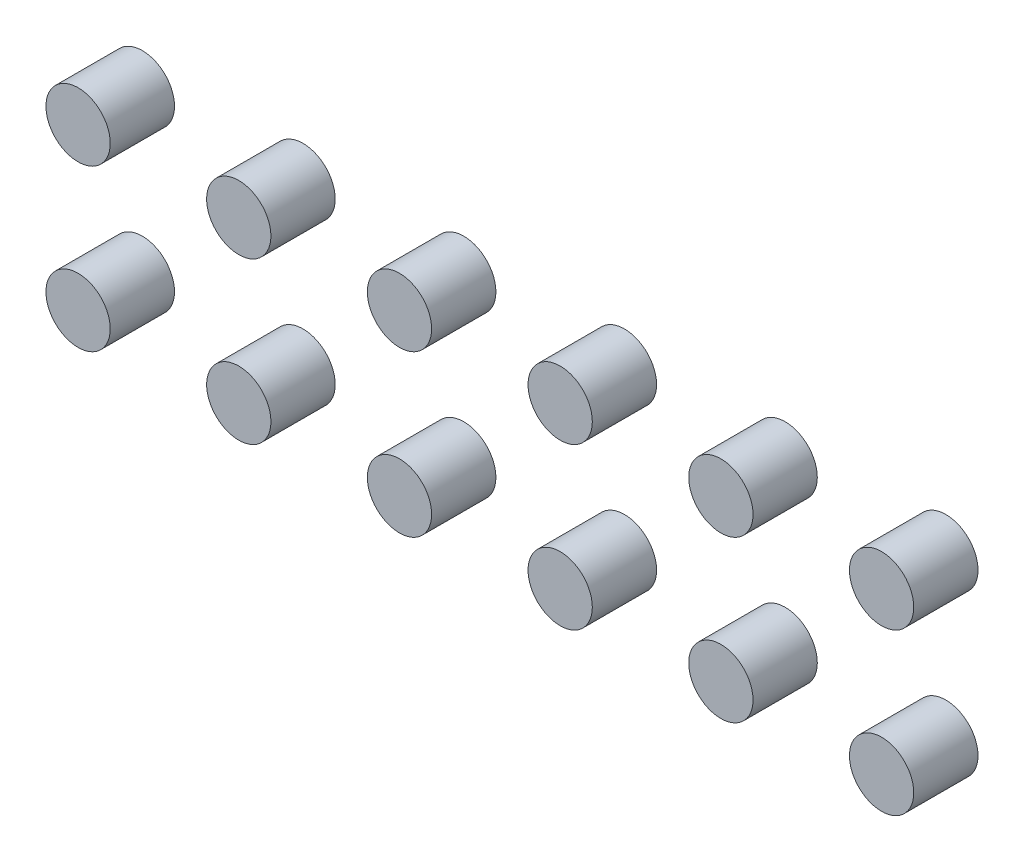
ISO-10303-21;
HEADER;
FILE_DESCRIPTION(('STEP AP214'),'2;1');
FILE_NAME('part.step','',(''),(''),'','','');
FILE_SCHEMA(('AUTOMOTIVE_DESIGN { 1 0 10303 214 1 1 1 1 }'));
ENDSEC;
DATA;
#1=APPLICATION_CONTEXT('core data for automotive mechanical design processes');
#2=APPLICATION_PROTOCOL_DEFINITION('international standard','automotive_design',2000,#1);
#3=PRODUCT_CONTEXT('',#1,'mechanical');
#4=PRODUCT('Part','Part','',(#3));
#5=PRODUCT_RELATED_PRODUCT_CATEGORY('part','',(#4));
#6=PRODUCT_DEFINITION_FORMATION('','',#4);
#7=PRODUCT_DEFINITION_CONTEXT('part definition',#1,'design');
#8=PRODUCT_DEFINITION('design','',#6,#7);
#9=PRODUCT_DEFINITION_SHAPE('','',#8);
#10=(LENGTH_UNIT() NAMED_UNIT(*) SI_UNIT(.MILLI.,.METRE.));
#11=(NAMED_UNIT(*) PLANE_ANGLE_UNIT() SI_UNIT($,.RADIAN.));
#12=(NAMED_UNIT(*) SI_UNIT($,.STERADIAN.) SOLID_ANGLE_UNIT());
#13=UNCERTAINTY_MEASURE_WITH_UNIT(LENGTH_MEASURE(1.E-05),#10,'distance_accuracy_value','');
#14=(GEOMETRIC_REPRESENTATION_CONTEXT(3) GLOBAL_UNCERTAINTY_ASSIGNED_CONTEXT((#13)) GLOBAL_UNIT_ASSIGNED_CONTEXT((#10,
#11,#12)) REPRESENTATION_CONTEXT('',''));
#15=CARTESIAN_POINT('',(0.,0.,0.));
#16=DIRECTION('',(0.,0.,1.));
#17=DIRECTION('',(1.,0.,0.));
#18=AXIS2_PLACEMENT_3D('',#15,#16,#17);
#19=CARTESIAN_POINT('',(250.,50.,-10.));
#20=DIRECTION('',(0.,0.,1.));
#21=DIRECTION('',(1.,0.,0.));
#22=AXIS2_PLACEMENT_3D('',#19,#20,#21);
#23=CYLINDRICAL_SURFACE('',#22,9.99999999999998);
#24=CARTESIAN_POINT('',(250.,50.,-10.));
#25=DIRECTION('',(0.,0.,1.));
#26=DIRECTION('',(1.,0.,0.));
#27=AXIS2_PLACEMENT_3D('',#24,#25,#26);
#28=CIRCLE('',#27,9.99999999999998);
#29=CARTESIAN_POINT('',(260.,50.,-10.));
#30=VERTEX_POINT('',#29);
#31=EDGE_CURVE('E11',#30,#30,#28,.T.);
#32=ORIENTED_EDGE('',*,*,#31,.T.);
#33=EDGE_LOOP('',(#32));
#34=FACE_BOUND('',#33,.T.);
#35=CARTESIAN_POINT('',(250.,50.,10.));
#36=DIRECTION('',(0.,0.,1.));
#37=DIRECTION('',(1.,0.,0.));
#38=AXIS2_PLACEMENT_3D('',#35,#36,#37);
#39=CIRCLE('',#38,9.99999999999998);
#40=CARTESIAN_POINT('',(260.,50.,10.));
#41=VERTEX_POINT('',#40);
#42=EDGE_CURVE('E43',#41,#41,#39,.T.);
#43=ORIENTED_EDGE('',*,*,#42,.F.);
#44=EDGE_LOOP('',(#43));
#45=FACE_BOUND('',#44,.T.);
#46=ADVANCED_FACE('F37',(#34,#45),#23,.T.);
#47=CARTESIAN_POINT('',(250.,50.,-10.));
#48=DIRECTION('',(0.,0.,1.));
#49=DIRECTION('',(1.,0.,0.));
#50=AXIS2_PLACEMENT_3D('',#47,#48,#49);
#51=PLANE('',#50);
#52=ORIENTED_EDGE('',*,*,#31,.F.);
#53=EDGE_LOOP('',(#52));
#54=FACE_BOUND('',#53,.T.);
#55=ADVANCED_FACE('F52',(#54),#51,.F.);
#56=CARTESIAN_POINT('',(250.,50.,10.));
#57=DIRECTION('',(0.,0.,1.));
#58=DIRECTION('',(1.,0.,0.));
#59=AXIS2_PLACEMENT_3D('',#56,#57,#58);
#60=PLANE('',#59);
#61=ORIENTED_EDGE('',*,*,#42,.T.);
#62=EDGE_LOOP('',(#61));
#63=FACE_BOUND('',#62,.T.);
#64=ADVANCED_FACE('F49',(#63),#60,.T.);
#65=CLOSED_SHELL('',(#46,#55,#64));
#66=MANIFOLD_SOLID_BREP('B2',#65);
#67=CARTESIAN_POINT('',(200.,50.,-10.));
#68=DIRECTION('',(0.,0.,1.));
#69=DIRECTION('',(1.,0.,0.));
#70=AXIS2_PLACEMENT_3D('',#67,#68,#69);
#71=CYLINDRICAL_SURFACE('',#70,10.);
#72=CARTESIAN_POINT('',(200.,50.,-10.));
#73=DIRECTION('',(0.,0.,1.));
#74=DIRECTION('',(1.,0.,0.));
#75=AXIS2_PLACEMENT_3D('',#72,#73,#74);
#76=CIRCLE('',#75,10.);
#77=CARTESIAN_POINT('',(210.,50.,-10.));
#78=VERTEX_POINT('',#77);
#79=EDGE_CURVE('E36',#78,#78,#76,.T.);
#80=ORIENTED_EDGE('',*,*,#79,.T.);
#81=EDGE_LOOP('',(#80));
#82=FACE_BOUND('',#81,.T.);
#83=CARTESIAN_POINT('',(200.,50.,10.));
#84=DIRECTION('',(0.,0.,1.));
#85=DIRECTION('',(1.,0.,0.));
#86=AXIS2_PLACEMENT_3D('',#83,#84,#85);
#87=CIRCLE('',#86,10.);
#88=CARTESIAN_POINT('',(210.,50.,10.));
#89=VERTEX_POINT('',#88);
#90=EDGE_CURVE('E91',#89,#89,#87,.T.);
#91=ORIENTED_EDGE('',*,*,#90,.F.);
#92=EDGE_LOOP('',(#91));
#93=FACE_BOUND('',#92,.T.);
#94=ADVANCED_FACE('F85',(#82,#93),#71,.T.);
#95=CARTESIAN_POINT('',(200.,50.,-10.));
#96=DIRECTION('',(0.,0.,1.));
#97=DIRECTION('',(1.,0.,0.));
#98=AXIS2_PLACEMENT_3D('',#95,#96,#97);
#99=PLANE('',#98);
#100=ORIENTED_EDGE('',*,*,#79,.F.);
#101=EDGE_LOOP('',(#100));
#102=FACE_BOUND('',#101,.T.);
#103=ADVANCED_FACE('F100',(#102),#99,.F.);
#104=CARTESIAN_POINT('',(200.,50.,10.));
#105=DIRECTION('',(0.,0.,1.));
#106=DIRECTION('',(1.,0.,0.));
#107=AXIS2_PLACEMENT_3D('',#104,#105,#106);
#108=PLANE('',#107);
#109=ORIENTED_EDGE('',*,*,#90,.T.);
#110=EDGE_LOOP('',(#109));
#111=FACE_BOUND('',#110,.T.);
#112=ADVANCED_FACE('F97',(#111),#108,.T.);
#113=CLOSED_SHELL('',(#94,#103,#112));
#114=MANIFOLD_SOLID_BREP('B6',#113);
#115=CARTESIAN_POINT('',(150.,50.,-10.));
#116=DIRECTION('',(0.,0.,1.));
#117=DIRECTION('',(1.,0.,0.));
#118=AXIS2_PLACEMENT_3D('',#115,#116,#117);
#119=CYLINDRICAL_SURFACE('',#118,10.);
#120=CARTESIAN_POINT('',(150.,50.,-10.));
#121=DIRECTION('',(0.,0.,1.));
#122=DIRECTION('',(1.,0.,0.));
#123=AXIS2_PLACEMENT_3D('',#120,#121,#122);
#124=CIRCLE('',#123,10.);
#125=CARTESIAN_POINT('',(160.,50.,-10.));
#126=VERTEX_POINT('',#125);
#127=EDGE_CURVE('E84',#126,#126,#124,.T.);
#128=ORIENTED_EDGE('',*,*,#127,.T.);
#129=EDGE_LOOP('',(#128));
#130=FACE_BOUND('',#129,.T.);
#131=CARTESIAN_POINT('',(150.,50.,10.));
#132=DIRECTION('',(0.,0.,1.));
#133=DIRECTION('',(1.,0.,0.));
#134=AXIS2_PLACEMENT_3D('',#131,#132,#133);
#135=CIRCLE('',#134,10.);
#136=CARTESIAN_POINT('',(160.,50.,10.));
#137=VERTEX_POINT('',#136);
#138=EDGE_CURVE('E139',#137,#137,#135,.T.);
#139=ORIENTED_EDGE('',*,*,#138,.F.);
#140=EDGE_LOOP('',(#139));
#141=FACE_BOUND('',#140,.T.);
#142=ADVANCED_FACE('F133',(#130,#141),#119,.T.);
#143=CARTESIAN_POINT('',(150.,50.,-10.));
#144=DIRECTION('',(0.,0.,1.));
#145=DIRECTION('',(1.,0.,0.));
#146=AXIS2_PLACEMENT_3D('',#143,#144,#145);
#147=PLANE('',#146);
#148=ORIENTED_EDGE('',*,*,#127,.F.);
#149=EDGE_LOOP('',(#148));
#150=FACE_BOUND('',#149,.T.);
#151=ADVANCED_FACE('F148',(#150),#147,.F.);
#152=CARTESIAN_POINT('',(150.,50.,10.));
#153=DIRECTION('',(0.,0.,1.));
#154=DIRECTION('',(1.,0.,0.));
#155=AXIS2_PLACEMENT_3D('',#152,#153,#154);
#156=PLANE('',#155);
#157=ORIENTED_EDGE('',*,*,#138,.T.);
#158=EDGE_LOOP('',(#157));
#159=FACE_BOUND('',#158,.T.);
#160=ADVANCED_FACE('F145',(#159),#156,.T.);
#161=CLOSED_SHELL('',(#142,#151,#160));
#162=MANIFOLD_SOLID_BREP('B31',#161);
#163=CARTESIAN_POINT('',(100.,50.,-10.));
#164=DIRECTION('',(0.,0.,1.));
#165=DIRECTION('',(1.,0.,0.));
#166=AXIS2_PLACEMENT_3D('',#163,#164,#165);
#167=CYLINDRICAL_SURFACE('',#166,9.99999999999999);
#168=CARTESIAN_POINT('',(100.,50.,-10.));
#169=DIRECTION('',(0.,0.,1.));
#170=DIRECTION('',(1.,0.,0.));
#171=AXIS2_PLACEMENT_3D('',#168,#169,#170);
#172=CIRCLE('',#171,9.99999999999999);
#173=CARTESIAN_POINT('',(110.,50.,-10.));
#174=VERTEX_POINT('',#173);
#175=EDGE_CURVE('E132',#174,#174,#172,.T.);
#176=ORIENTED_EDGE('',*,*,#175,.T.);
#177=EDGE_LOOP('',(#176));
#178=FACE_BOUND('',#177,.T.);
#179=CARTESIAN_POINT('',(100.,50.,10.));
#180=DIRECTION('',(0.,0.,1.));
#181=DIRECTION('',(1.,0.,0.));
#182=AXIS2_PLACEMENT_3D('',#179,#180,#181);
#183=CIRCLE('',#182,9.99999999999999);
#184=CARTESIAN_POINT('',(110.,50.,10.));
#185=VERTEX_POINT('',#184);
#186=EDGE_CURVE('E187',#185,#185,#183,.T.);
#187=ORIENTED_EDGE('',*,*,#186,.F.);
#188=EDGE_LOOP('',(#187));
#189=FACE_BOUND('',#188,.T.);
#190=ADVANCED_FACE('F181',(#178,#189),#167,.T.);
#191=CARTESIAN_POINT('',(100.,50.,-10.));
#192=DIRECTION('',(0.,0.,1.));
#193=DIRECTION('',(1.,0.,0.));
#194=AXIS2_PLACEMENT_3D('',#191,#192,#193);
#195=PLANE('',#194);
#196=ORIENTED_EDGE('',*,*,#175,.F.);
#197=EDGE_LOOP('',(#196));
#198=FACE_BOUND('',#197,.T.);
#199=ADVANCED_FACE('F196',(#198),#195,.F.);
#200=CARTESIAN_POINT('',(100.,50.,10.));
#201=DIRECTION('',(0.,0.,1.));
#202=DIRECTION('',(1.,0.,0.));
#203=AXIS2_PLACEMENT_3D('',#200,#201,#202);
#204=PLANE('',#203);
#205=ORIENTED_EDGE('',*,*,#186,.T.);
#206=EDGE_LOOP('',(#205));
#207=FACE_BOUND('',#206,.T.);
#208=ADVANCED_FACE('F193',(#207),#204,.T.);
#209=CLOSED_SHELL('',(#190,#199,#208));
#210=MANIFOLD_SOLID_BREP('B79',#209);
#211=CARTESIAN_POINT('',(50.,50.,-10.));
#212=DIRECTION('',(0.,0.,1.));
#213=DIRECTION('',(1.,0.,0.));
#214=AXIS2_PLACEMENT_3D('',#211,#212,#213);
#215=CYLINDRICAL_SURFACE('',#214,10.);
#216=CARTESIAN_POINT('',(50.,50.,-10.));
#217=DIRECTION('',(0.,0.,1.));
#218=DIRECTION('',(1.,0.,0.));
#219=AXIS2_PLACEMENT_3D('',#216,#217,#218);
#220=CIRCLE('',#219,10.);
#221=CARTESIAN_POINT('',(60.,50.,-10.));
#222=VERTEX_POINT('',#221);
#223=EDGE_CURVE('E180',#222,#222,#220,.T.);
#224=ORIENTED_EDGE('',*,*,#223,.T.);
#225=EDGE_LOOP('',(#224));
#226=FACE_BOUND('',#225,.T.);
#227=CARTESIAN_POINT('',(50.,50.,10.));
#228=DIRECTION('',(0.,0.,1.));
#229=DIRECTION('',(1.,0.,0.));
#230=AXIS2_PLACEMENT_3D('',#227,#228,#229);
#231=CIRCLE('',#230,10.);
#232=CARTESIAN_POINT('',(60.,50.,10.));
#233=VERTEX_POINT('',#232);
#234=EDGE_CURVE('E235',#233,#233,#231,.T.);
#235=ORIENTED_EDGE('',*,*,#234,.F.);
#236=EDGE_LOOP('',(#235));
#237=FACE_BOUND('',#236,.T.);
#238=ADVANCED_FACE('F229',(#226,#237),#215,.T.);
#239=CARTESIAN_POINT('',(50.,50.,-10.));
#240=DIRECTION('',(0.,0.,1.));
#241=DIRECTION('',(1.,0.,0.));
#242=AXIS2_PLACEMENT_3D('',#239,#240,#241);
#243=PLANE('',#242);
#244=ORIENTED_EDGE('',*,*,#223,.F.);
#245=EDGE_LOOP('',(#244));
#246=FACE_BOUND('',#245,.T.);
#247=ADVANCED_FACE('F244',(#246),#243,.F.);
#248=CARTESIAN_POINT('',(50.,50.,10.));
#249=DIRECTION('',(0.,0.,1.));
#250=DIRECTION('',(1.,0.,0.));
#251=AXIS2_PLACEMENT_3D('',#248,#249,#250);
#252=PLANE('',#251);
#253=ORIENTED_EDGE('',*,*,#234,.T.);
#254=EDGE_LOOP('',(#253));
#255=FACE_BOUND('',#254,.T.);
#256=ADVANCED_FACE('F241',(#255),#252,.T.);
#257=CLOSED_SHELL('',(#238,#247,#256));
#258=MANIFOLD_SOLID_BREP('B127',#257);
#259=CARTESIAN_POINT('',(0.,50.,-10.));
#260=DIRECTION('',(0.,0.,1.));
#261=DIRECTION('',(1.,0.,0.));
#262=AXIS2_PLACEMENT_3D('',#259,#260,#261);
#263=CYLINDRICAL_SURFACE('',#262,10.);
#264=CARTESIAN_POINT('',(0.,50.,-10.));
#265=DIRECTION('',(0.,0.,1.));
#266=DIRECTION('',(1.,0.,0.));
#267=AXIS2_PLACEMENT_3D('',#264,#265,#266);
#268=CIRCLE('',#267,10.);
#269=CARTESIAN_POINT('',(10.,50.,-10.));
#270=VERTEX_POINT('',#269);
#271=EDGE_CURVE('E228',#270,#270,#268,.T.);
#272=ORIENTED_EDGE('',*,*,#271,.T.);
#273=EDGE_LOOP('',(#272));
#274=FACE_BOUND('',#273,.T.);
#275=CARTESIAN_POINT('',(0.,50.,10.));
#276=DIRECTION('',(0.,0.,1.));
#277=DIRECTION('',(1.,0.,0.));
#278=AXIS2_PLACEMENT_3D('',#275,#276,#277);
#279=CIRCLE('',#278,10.);
#280=CARTESIAN_POINT('',(10.,50.,10.));
#281=VERTEX_POINT('',#280);
#282=EDGE_CURVE('E283',#281,#281,#279,.T.);
#283=ORIENTED_EDGE('',*,*,#282,.F.);
#284=EDGE_LOOP('',(#283));
#285=FACE_BOUND('',#284,.T.);
#286=ADVANCED_FACE('F277',(#274,#285),#263,.T.);
#287=CARTESIAN_POINT('',(0.,50.,-10.));
#288=DIRECTION('',(0.,0.,1.));
#289=DIRECTION('',(1.,0.,0.));
#290=AXIS2_PLACEMENT_3D('',#287,#288,#289);
#291=PLANE('',#290);
#292=ORIENTED_EDGE('',*,*,#271,.F.);
#293=EDGE_LOOP('',(#292));
#294=FACE_BOUND('',#293,.T.);
#295=ADVANCED_FACE('F292',(#294),#291,.F.);
#296=CARTESIAN_POINT('',(0.,50.,10.));
#297=DIRECTION('',(0.,0.,1.));
#298=DIRECTION('',(1.,0.,0.));
#299=AXIS2_PLACEMENT_3D('',#296,#297,#298);
#300=PLANE('',#299);
#301=ORIENTED_EDGE('',*,*,#282,.T.);
#302=EDGE_LOOP('',(#301));
#303=FACE_BOUND('',#302,.T.);
#304=ADVANCED_FACE('F289',(#303),#300,.T.);
#305=CLOSED_SHELL('',(#286,#295,#304));
#306=MANIFOLD_SOLID_BREP('B175',#305);
#307=CARTESIAN_POINT('',(250.,0.,-10.));
#308=DIRECTION('',(0.,0.,1.));
#309=DIRECTION('',(1.,0.,0.));
#310=AXIS2_PLACEMENT_3D('',#307,#308,#309);
#311=CYLINDRICAL_SURFACE('',#310,9.99999999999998);
#312=CARTESIAN_POINT('',(250.,0.,-10.));
#313=DIRECTION('',(0.,0.,1.));
#314=DIRECTION('',(1.,0.,0.));
#315=AXIS2_PLACEMENT_3D('',#312,#313,#314);
#316=CIRCLE('',#315,9.99999999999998);
#317=CARTESIAN_POINT('',(260.,0.,-10.));
#318=VERTEX_POINT('',#317);
#319=EDGE_CURVE('E276',#318,#318,#316,.T.);
#320=ORIENTED_EDGE('',*,*,#319,.T.);
#321=EDGE_LOOP('',(#320));
#322=FACE_BOUND('',#321,.T.);
#323=CARTESIAN_POINT('',(250.,0.,10.));
#324=DIRECTION('',(0.,0.,1.));
#325=DIRECTION('',(1.,0.,0.));
#326=AXIS2_PLACEMENT_3D('',#323,#324,#325);
#327=CIRCLE('',#326,9.99999999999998);
#328=CARTESIAN_POINT('',(260.,0.,10.));
#329=VERTEX_POINT('',#328);
#330=EDGE_CURVE('E331',#329,#329,#327,.T.);
#331=ORIENTED_EDGE('',*,*,#330,.F.);
#332=EDGE_LOOP('',(#331));
#333=FACE_BOUND('',#332,.T.);
#334=ADVANCED_FACE('F325',(#322,#333),#311,.T.);
#335=CARTESIAN_POINT('',(250.,0.,-10.));
#336=DIRECTION('',(0.,0.,1.));
#337=DIRECTION('',(1.,0.,0.));
#338=AXIS2_PLACEMENT_3D('',#335,#336,#337);
#339=PLANE('',#338);
#340=ORIENTED_EDGE('',*,*,#319,.F.);
#341=EDGE_LOOP('',(#340));
#342=FACE_BOUND('',#341,.T.);
#343=ADVANCED_FACE('F340',(#342),#339,.F.);
#344=CARTESIAN_POINT('',(250.,0.,10.));
#345=DIRECTION('',(0.,0.,1.));
#346=DIRECTION('',(1.,0.,0.));
#347=AXIS2_PLACEMENT_3D('',#344,#345,#346);
#348=PLANE('',#347);
#349=ORIENTED_EDGE('',*,*,#330,.T.);
#350=EDGE_LOOP('',(#349));
#351=FACE_BOUND('',#350,.T.);
#352=ADVANCED_FACE('F337',(#351),#348,.T.);
#353=CLOSED_SHELL('',(#334,#343,#352));
#354=MANIFOLD_SOLID_BREP('B223',#353);
#355=CARTESIAN_POINT('',(200.,0.,-10.));
#356=DIRECTION('',(0.,0.,1.));
#357=DIRECTION('',(1.,0.,0.));
#358=AXIS2_PLACEMENT_3D('',#355,#356,#357);
#359=CYLINDRICAL_SURFACE('',#358,10.);
#360=CARTESIAN_POINT('',(200.,0.,-10.));
#361=DIRECTION('',(0.,0.,1.));
#362=DIRECTION('',(1.,0.,0.));
#363=AXIS2_PLACEMENT_3D('',#360,#361,#362);
#364=CIRCLE('',#363,10.);
#365=CARTESIAN_POINT('',(210.,0.,-10.));
#366=VERTEX_POINT('',#365);
#367=EDGE_CURVE('E324',#366,#366,#364,.T.);
#368=ORIENTED_EDGE('',*,*,#367,.T.);
#369=EDGE_LOOP('',(#368));
#370=FACE_BOUND('',#369,.T.);
#371=CARTESIAN_POINT('',(200.,0.,10.));
#372=DIRECTION('',(0.,0.,1.));
#373=DIRECTION('',(1.,0.,0.));
#374=AXIS2_PLACEMENT_3D('',#371,#372,#373);
#375=CIRCLE('',#374,10.);
#376=CARTESIAN_POINT('',(210.,0.,10.));
#377=VERTEX_POINT('',#376);
#378=EDGE_CURVE('E379',#377,#377,#375,.T.);
#379=ORIENTED_EDGE('',*,*,#378,.F.);
#380=EDGE_LOOP('',(#379));
#381=FACE_BOUND('',#380,.T.);
#382=ADVANCED_FACE('F373',(#370,#381),#359,.T.);
#383=CARTESIAN_POINT('',(200.,0.,-10.));
#384=DIRECTION('',(0.,0.,1.));
#385=DIRECTION('',(1.,0.,0.));
#386=AXIS2_PLACEMENT_3D('',#383,#384,#385);
#387=PLANE('',#386);
#388=ORIENTED_EDGE('',*,*,#367,.F.);
#389=EDGE_LOOP('',(#388));
#390=FACE_BOUND('',#389,.T.);
#391=ADVANCED_FACE('F388',(#390),#387,.F.);
#392=CARTESIAN_POINT('',(200.,0.,10.));
#393=DIRECTION('',(0.,0.,1.));
#394=DIRECTION('',(1.,0.,0.));
#395=AXIS2_PLACEMENT_3D('',#392,#393,#394);
#396=PLANE('',#395);
#397=ORIENTED_EDGE('',*,*,#378,.T.);
#398=EDGE_LOOP('',(#397));
#399=FACE_BOUND('',#398,.T.);
#400=ADVANCED_FACE('F385',(#399),#396,.T.);
#401=CLOSED_SHELL('',(#382,#391,#400));
#402=MANIFOLD_SOLID_BREP('B271',#401);
#403=CARTESIAN_POINT('',(150.,0.,-10.));
#404=DIRECTION('',(0.,0.,1.));
#405=DIRECTION('',(1.,0.,0.));
#406=AXIS2_PLACEMENT_3D('',#403,#404,#405);
#407=CYLINDRICAL_SURFACE('',#406,10.);
#408=CARTESIAN_POINT('',(150.,0.,-10.));
#409=DIRECTION('',(0.,0.,1.));
#410=DIRECTION('',(1.,0.,0.));
#411=AXIS2_PLACEMENT_3D('',#408,#409,#410);
#412=CIRCLE('',#411,10.);
#413=CARTESIAN_POINT('',(160.,0.,-10.));
#414=VERTEX_POINT('',#413);
#415=EDGE_CURVE('E372',#414,#414,#412,.T.);
#416=ORIENTED_EDGE('',*,*,#415,.T.);
#417=EDGE_LOOP('',(#416));
#418=FACE_BOUND('',#417,.T.);
#419=CARTESIAN_POINT('',(150.,0.,10.));
#420=DIRECTION('',(0.,0.,1.));
#421=DIRECTION('',(1.,0.,0.));
#422=AXIS2_PLACEMENT_3D('',#419,#420,#421);
#423=CIRCLE('',#422,10.);
#424=CARTESIAN_POINT('',(160.,0.,10.));
#425=VERTEX_POINT('',#424);
#426=EDGE_CURVE('E427',#425,#425,#423,.T.);
#427=ORIENTED_EDGE('',*,*,#426,.F.);
#428=EDGE_LOOP('',(#427));
#429=FACE_BOUND('',#428,.T.);
#430=ADVANCED_FACE('F421',(#418,#429),#407,.T.);
#431=CARTESIAN_POINT('',(150.,0.,-10.));
#432=DIRECTION('',(0.,0.,1.));
#433=DIRECTION('',(1.,0.,0.));
#434=AXIS2_PLACEMENT_3D('',#431,#432,#433);
#435=PLANE('',#434);
#436=ORIENTED_EDGE('',*,*,#415,.F.);
#437=EDGE_LOOP('',(#436));
#438=FACE_BOUND('',#437,.T.);
#439=ADVANCED_FACE('F436',(#438),#435,.F.);
#440=CARTESIAN_POINT('',(150.,0.,10.));
#441=DIRECTION('',(0.,0.,1.));
#442=DIRECTION('',(1.,0.,0.));
#443=AXIS2_PLACEMENT_3D('',#440,#441,#442);
#444=PLANE('',#443);
#445=ORIENTED_EDGE('',*,*,#426,.T.);
#446=EDGE_LOOP('',(#445));
#447=FACE_BOUND('',#446,.T.);
#448=ADVANCED_FACE('F433',(#447),#444,.T.);
#449=CLOSED_SHELL('',(#430,#439,#448));
#450=MANIFOLD_SOLID_BREP('B319',#449);
#451=CARTESIAN_POINT('',(100.,0.,-10.));
#452=DIRECTION('',(0.,0.,1.));
#453=DIRECTION('',(1.,0.,0.));
#454=AXIS2_PLACEMENT_3D('',#451,#452,#453);
#455=CYLINDRICAL_SURFACE('',#454,9.99999999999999);
#456=CARTESIAN_POINT('',(100.,0.,-10.));
#457=DIRECTION('',(0.,0.,1.));
#458=DIRECTION('',(1.,0.,0.));
#459=AXIS2_PLACEMENT_3D('',#456,#457,#458);
#460=CIRCLE('',#459,9.99999999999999);
#461=CARTESIAN_POINT('',(110.,0.,-10.));
#462=VERTEX_POINT('',#461);
#463=EDGE_CURVE('E420',#462,#462,#460,.T.);
#464=ORIENTED_EDGE('',*,*,#463,.T.);
#465=EDGE_LOOP('',(#464));
#466=FACE_BOUND('',#465,.T.);
#467=CARTESIAN_POINT('',(100.,0.,10.));
#468=DIRECTION('',(0.,0.,1.));
#469=DIRECTION('',(1.,0.,0.));
#470=AXIS2_PLACEMENT_3D('',#467,#468,#469);
#471=CIRCLE('',#470,9.99999999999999);
#472=CARTESIAN_POINT('',(110.,0.,10.));
#473=VERTEX_POINT('',#472);
#474=EDGE_CURVE('E475',#473,#473,#471,.T.);
#475=ORIENTED_EDGE('',*,*,#474,.F.);
#476=EDGE_LOOP('',(#475));
#477=FACE_BOUND('',#476,.T.);
#478=ADVANCED_FACE('F469',(#466,#477),#455,.T.);
#479=CARTESIAN_POINT('',(100.,0.,-10.));
#480=DIRECTION('',(0.,0.,1.));
#481=DIRECTION('',(1.,0.,0.));
#482=AXIS2_PLACEMENT_3D('',#479,#480,#481);
#483=PLANE('',#482);
#484=ORIENTED_EDGE('',*,*,#463,.F.);
#485=EDGE_LOOP('',(#484));
#486=FACE_BOUND('',#485,.T.);
#487=ADVANCED_FACE('F484',(#486),#483,.F.);
#488=CARTESIAN_POINT('',(100.,0.,10.));
#489=DIRECTION('',(0.,0.,1.));
#490=DIRECTION('',(1.,0.,0.));
#491=AXIS2_PLACEMENT_3D('',#488,#489,#490);
#492=PLANE('',#491);
#493=ORIENTED_EDGE('',*,*,#474,.T.);
#494=EDGE_LOOP('',(#493));
#495=FACE_BOUND('',#494,.T.);
#496=ADVANCED_FACE('F481',(#495),#492,.T.);
#497=CLOSED_SHELL('',(#478,#487,#496));
#498=MANIFOLD_SOLID_BREP('B367',#497);
#499=CARTESIAN_POINT('',(50.,0.,-10.));
#500=DIRECTION('',(0.,0.,1.));
#501=DIRECTION('',(1.,0.,0.));
#502=AXIS2_PLACEMENT_3D('',#499,#500,#501);
#503=CYLINDRICAL_SURFACE('',#502,10.);
#504=CARTESIAN_POINT('',(50.,0.,-10.));
#505=DIRECTION('',(0.,0.,1.));
#506=DIRECTION('',(1.,0.,0.));
#507=AXIS2_PLACEMENT_3D('',#504,#505,#506);
#508=CIRCLE('',#507,10.);
#509=CARTESIAN_POINT('',(60.,0.,-10.));
#510=VERTEX_POINT('',#509);
#511=EDGE_CURVE('E468',#510,#510,#508,.T.);
#512=ORIENTED_EDGE('',*,*,#511,.T.);
#513=EDGE_LOOP('',(#512));
#514=FACE_BOUND('',#513,.T.);
#515=CARTESIAN_POINT('',(50.,0.,10.));
#516=DIRECTION('',(0.,0.,1.));
#517=DIRECTION('',(1.,0.,0.));
#518=AXIS2_PLACEMENT_3D('',#515,#516,#517);
#519=CIRCLE('',#518,10.);
#520=CARTESIAN_POINT('',(60.,0.,10.));
#521=VERTEX_POINT('',#520);
#522=EDGE_CURVE('E522',#521,#521,#519,.T.);
#523=ORIENTED_EDGE('',*,*,#522,.F.);
#524=EDGE_LOOP('',(#523));
#525=FACE_BOUND('',#524,.T.);
#526=ADVANCED_FACE('F516',(#514,#525),#503,.T.);
#527=CARTESIAN_POINT('',(50.,0.,-10.));
#528=DIRECTION('',(0.,0.,1.));
#529=DIRECTION('',(1.,0.,0.));
#530=AXIS2_PLACEMENT_3D('',#527,#528,#529);
#531=PLANE('',#530);
#532=ORIENTED_EDGE('',*,*,#511,.F.);
#533=EDGE_LOOP('',(#532));
#534=FACE_BOUND('',#533,.T.);
#535=ADVANCED_FACE('F531',(#534),#531,.F.);
#536=CARTESIAN_POINT('',(50.,0.,10.));
#537=DIRECTION('',(0.,0.,1.));
#538=DIRECTION('',(1.,0.,0.));
#539=AXIS2_PLACEMENT_3D('',#536,#537,#538);
#540=PLANE('',#539);
#541=ORIENTED_EDGE('',*,*,#522,.T.);
#542=EDGE_LOOP('',(#541));
#543=FACE_BOUND('',#542,.T.);
#544=ADVANCED_FACE('F528',(#543),#540,.T.);
#545=CLOSED_SHELL('',(#526,#535,#544));
#546=MANIFOLD_SOLID_BREP('B415',#545);
#547=CARTESIAN_POINT('',(0.,0.,-10.));
#548=DIRECTION('',(0.,0.,1.));
#549=DIRECTION('',(1.,0.,0.));
#550=AXIS2_PLACEMENT_3D('',#547,#548,#549);
#551=CYLINDRICAL_SURFACE('',#550,10.);
#552=CARTESIAN_POINT('',(0.,0.,-10.));
#553=DIRECTION('',(0.,0.,1.));
#554=DIRECTION('',(1.,0.,0.));
#555=AXIS2_PLACEMENT_3D('',#552,#553,#554);
#556=CIRCLE('',#555,10.);
#557=CARTESIAN_POINT('',(10.,0.,-10.));
#558=VERTEX_POINT('',#557);
#559=EDGE_CURVE('E515',#558,#558,#556,.T.);
#560=ORIENTED_EDGE('',*,*,#559,.T.);
#561=EDGE_LOOP('',(#560));
#562=FACE_BOUND('',#561,.T.);
#563=CARTESIAN_POINT('',(0.,0.,10.));
#564=DIRECTION('',(0.,0.,1.));
#565=DIRECTION('',(1.,0.,0.));
#566=AXIS2_PLACEMENT_3D('',#563,#564,#565);
#567=CIRCLE('',#566,10.);
#568=CARTESIAN_POINT('',(10.,0.,10.));
#569=VERTEX_POINT('',#568);
#570=EDGE_CURVE('E562',#569,#569,#567,.T.);
#571=ORIENTED_EDGE('',*,*,#570,.F.);
#572=EDGE_LOOP('',(#571));
#573=FACE_BOUND('',#572,.T.);
#574=ADVANCED_FACE('F556',(#562,#573),#551,.T.);
#575=CARTESIAN_POINT('',(0.,0.,-10.));
#576=DIRECTION('',(0.,0.,1.));
#577=DIRECTION('',(1.,0.,0.));
#578=AXIS2_PLACEMENT_3D('',#575,#576,#577);
#579=PLANE('',#578);
#580=ORIENTED_EDGE('',*,*,#559,.F.);
#581=EDGE_LOOP('',(#580));
#582=FACE_BOUND('',#581,.T.);
#583=ADVANCED_FACE('F571',(#582),#579,.F.);
#584=CARTESIAN_POINT('',(0.,0.,10.));
#585=DIRECTION('',(0.,0.,1.));
#586=DIRECTION('',(1.,0.,0.));
#587=AXIS2_PLACEMENT_3D('',#584,#585,#586);
#588=PLANE('',#587);
#589=ORIENTED_EDGE('',*,*,#570,.T.);
#590=EDGE_LOOP('',(#589));
#591=FACE_BOUND('',#590,.T.);
#592=ADVANCED_FACE('F568',(#591),#588,.T.);
#593=CLOSED_SHELL('',(#574,#583,#592));
#594=MANIFOLD_SOLID_BREP('B463',#593);
#595=ADVANCED_BREP_SHAPE_REPRESENTATION('',(#18,#66,#114,#162,#210,#258,#306,#354,#402,#450,
#498,#546,#594),#14);
#596=SHAPE_DEFINITION_REPRESENTATION(#9,#595);
ENDSEC;
END-ISO-10303-21;
